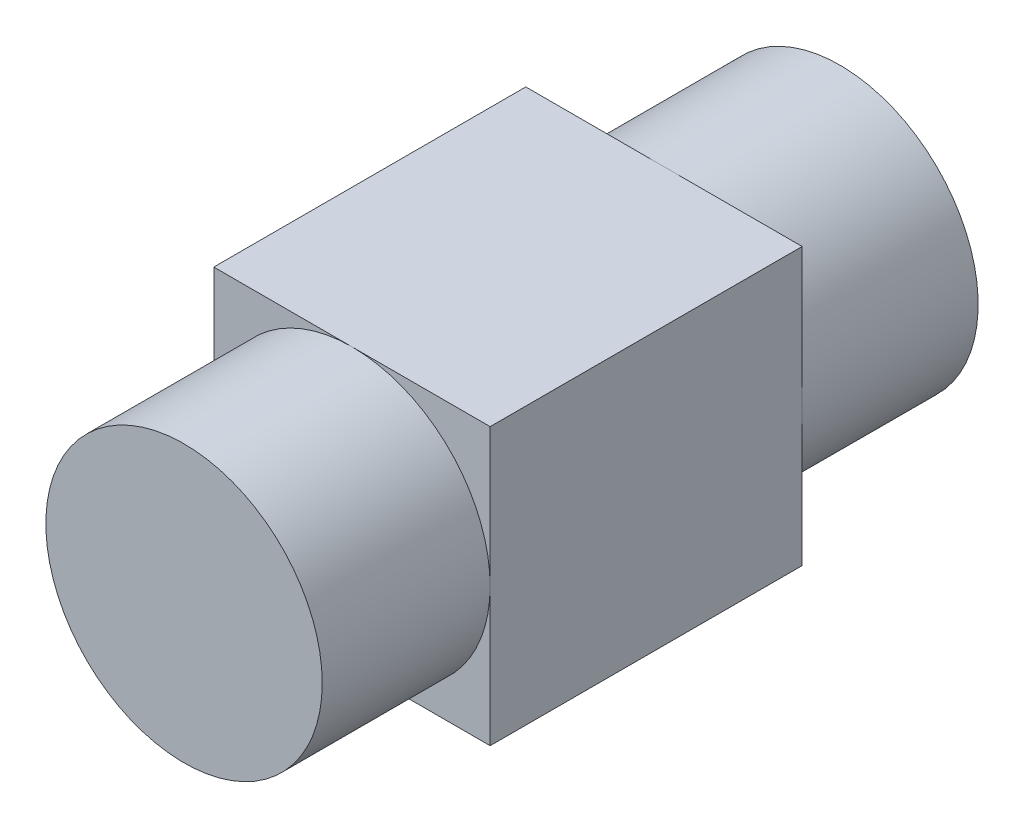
from build123d import *

# Parameters (mm, degrees)
SKETCH1_W           = 9.525
SKETCH1_H           = 9.525
BOSS_EXTRUDE1_DEPTH = 59.436
SKETCH2_OUTSIDE_W   = 23.714
SKETCH2_OUTSIDE_H   = 23.714
SKETCH2_OUTSIDE_R   = 4.7625
CUT_EXTRUDE1_DEPTH  = 58.923905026
SKETCH3_OUTSIDE_W   = 23.714
SKETCH3_OUTSIDE_H   = 23.714
SKETCH3_OUTSIDE_R   = 4.7625
CUT_EXTRUDE2_DEPTH  = 31.937553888
CUT_EXTRUDE3_START  = -24.13
SKETCH7_R           = 4.7625
CUT_EXTRUDE3_DEPTH  = 24.13


with BuildPart() as part:
    # Sketch1 → Boss-Extrude1 (new body)
    with BuildSketch(Plane.XY):
        Rectangle(SKETCH1_W, SKETCH1_H)
    extrude(amount=BOSS_EXTRUDE1_DEPTH)

    # Sketch2 outside → Cut-Extrude1 (cut, through all)
    with BuildSketch(Plane.XY.offset(57.531)):
        Rectangle(SKETCH2_OUTSIDE_W, SKETCH2_OUTSIDE_H)
        Circle(SKETCH2_OUTSIDE_R, mode=Mode.SUBTRACT)
    extrude(amount=CUT_EXTRUDE1_DEPTH, mode=Mode.SUBTRACT)

    # Sketch3 outside → Cut-Extrude2 (cut, through all)
    with BuildSketch(Plane.XY.offset(30.19552)):
        Rectangle(SKETCH3_OUTSIDE_W, SKETCH3_OUTSIDE_H)
        Circle(SKETCH3_OUTSIDE_R, mode=Mode.SUBTRACT)
    extrude(amount=-CUT_EXTRUDE2_DEPTH, mode=Mode.SUBTRACT)

    # Sketch6 → Cut-Revolve2 (revolve, cut)
    with BuildSketch(Plane(origin=(4.7625, 0, 0), x_dir=(0, 0, -1), z_dir=(0, 1, 0)), mode=Mode.PRIVATE) as cut_revolve2_sk:
        Polygon((-40.948360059, 14.636725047), (-40.948360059, 9.525), (-46.736, 9.525), (-46.736, 4.7625), (-59.436, 4.7625), (-59.436, 14.636725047), align=None)
    revolve(cut_revolve2_sk.sketch.rotate(Axis((0, 0, 63.838477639), (0, 0, -1)), 180), axis=Axis((0, 0, 63.838477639), (0, 0, -1)), mode=Mode.SUBTRACT)

    # Sketch7 → Cut-Extrude3 (cut)
    with BuildSketch(Plane(origin=(0, 0, 0), x_dir=(-1, 0, 0), z_dir=(0, 0, -1)).offset(CUT_EXTRUDE3_START)):
        Circle(SKETCH7_R)
    extrude(amount=CUT_EXTRUDE3_DEPTH, mode=Mode.SUBTRACT)


solid = part.part
